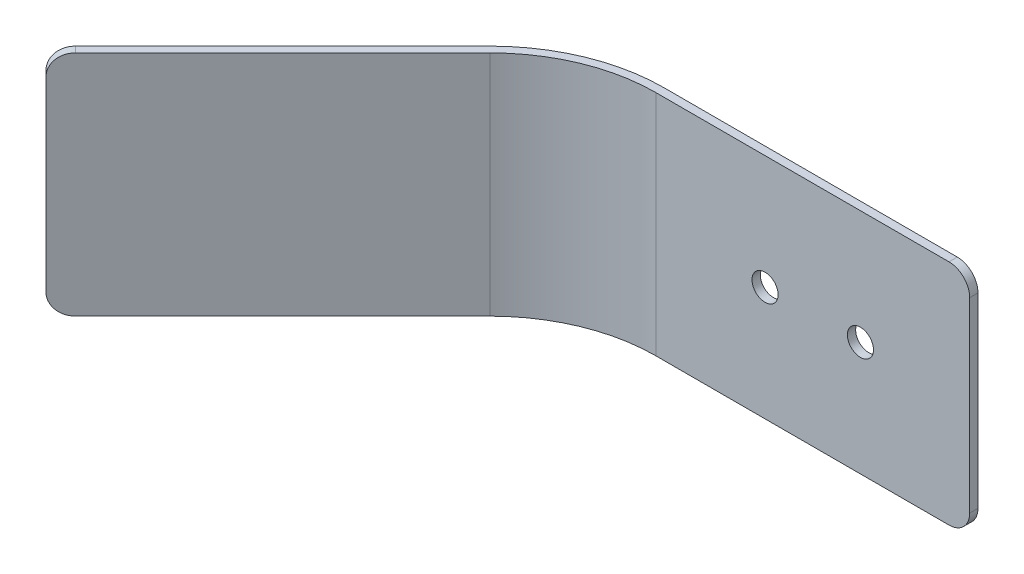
from build123d import *

# Parameters (mm, degrees)
SKETCH2_W           = 118.26875
SKETCH2_H           = 69.85
BOSS_EXTRUDE1_DEPTH = 2.54
SKETCH1_W           = 118.26875
SKETCH1_H           = 69.85
BOSS_EXTRUDE2_DEPTH = 2.54
FILLET3_R           = 50.8
CUT_EXTRUDE1_DEPTH  = 162.752578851
FILLET4_R           = 6.35
SKETCH5_R           = 4
CUT_EXTRUDE2_DEPTH  = 161.425655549


with BuildPart() as part:
    # Sketch2 → Boss-Extrude1 (new body)
    with BuildSketch(Plane(origin=(0, 0, 0), x_dir=(0.7071067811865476, 0, -0.7071067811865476), z_dir=(0.7071067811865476, 0, 0.7071067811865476))):
        with Locations((-59.134375, 34.925)):
            Rectangle(SKETCH2_W, SKETCH2_H)
    extrude(amount=BOSS_EXTRUDE1_DEPTH)

    # Sketch1 → Boss-Extrude2 (add)
    with BuildSketch(Plane.XY):
        with Locations((59.134375, 34.925)):
            Rectangle(SKETCH1_W, SKETCH1_H)
    extrude(amount=BOSS_EXTRUDE2_DEPTH)

    # Fillet3
    fillet3_edges = [part.edges().sort_by_distance(p)[0] for p in [
        (1.052102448, 34.925, 2.54),
    ]]
    fillet(fillet3_edges, radius=FILLET3_R)

    # Sketch3 → Cut-Extrude1 (cut, through all)
    with BuildSketch(Plane.XZ):
        with BuildLine():
            Line((22.094151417, 0), (0, 0))
            Line((0, 0), (-15.622924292, 15.622924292))
            ThreePointArc((-15.622924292, 15.622924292), (1.681817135, 4.060265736), (22.094151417, 0))
        make_face()
    extrude(amount=-CUT_EXTRUDE1_DEPTH, mode=Mode.SUBTRACT)

    # Fillet4
    fillet4_edges = [part.edges().sort_by_distance(p)[0] for p in [
        (118.26875, 69.85, 1.27),
        (118.26875, 0, 1.27),
        (-82.730609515, 0, 84.52666074),
        (-82.730609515, 69.85, 84.52666074),
    ]]
    fillet(fillet4_edges, radius=FILLET4_R)

    # Sketch5 → Cut-Extrude2 (cut, through all)
    with BuildSketch(Plane.XY.offset(2.54)):
        with Locations((55.576450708, 34.925)):
            Circle(SKETCH5_R)
        with Locations((84.786450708, 34.925)):
            Circle(SKETCH5_R)
    extrude(amount=-CUT_EXTRUDE2_DEPTH, mode=Mode.SUBTRACT)


solid = part.part
